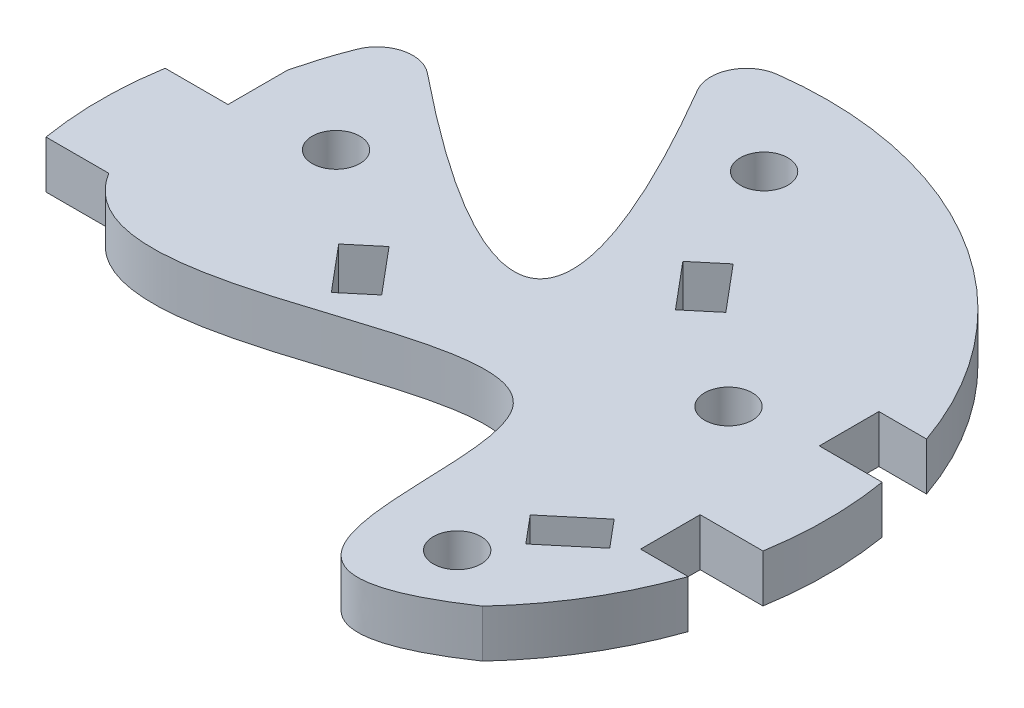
ISO-10303-21;
HEADER;
FILE_DESCRIPTION(('STEP AP214'),'2;1');
FILE_NAME('part.step','',(''),(''),'','','');
FILE_SCHEMA(('AUTOMOTIVE_DESIGN { 1 0 10303 214 1 1 1 1 }'));
ENDSEC;
DATA;
#1=APPLICATION_CONTEXT('core data for automotive mechanical design processes');
#2=APPLICATION_PROTOCOL_DEFINITION('international standard','automotive_design',2000,#1);
#3=PRODUCT_CONTEXT('',#1,'mechanical');
#4=PRODUCT('Part','Part','',(#3));
#5=PRODUCT_RELATED_PRODUCT_CATEGORY('part','',(#4));
#6=PRODUCT_DEFINITION_FORMATION('','',#4);
#7=PRODUCT_DEFINITION_CONTEXT('part definition',#1,'design');
#8=PRODUCT_DEFINITION('design','',#6,#7);
#9=PRODUCT_DEFINITION_SHAPE('','',#8);
#10=(LENGTH_UNIT() NAMED_UNIT(*) SI_UNIT(.MILLI.,.METRE.));
#11=(NAMED_UNIT(*) PLANE_ANGLE_UNIT() SI_UNIT($,.RADIAN.));
#12=(NAMED_UNIT(*) SI_UNIT($,.STERADIAN.) SOLID_ANGLE_UNIT());
#13=UNCERTAINTY_MEASURE_WITH_UNIT(LENGTH_MEASURE(1.E-05),#10,'distance_accuracy_value','');
#14=(GEOMETRIC_REPRESENTATION_CONTEXT(3) GLOBAL_UNCERTAINTY_ASSIGNED_CONTEXT((#13)) GLOBAL_UNIT_ASSIGNED_CONTEXT((#10,
#11,#12)) REPRESENTATION_CONTEXT('',''));
#15=CARTESIAN_POINT('',(0.,0.,0.));
#16=DIRECTION('',(0.,0.,1.));
#17=DIRECTION('',(1.,0.,0.));
#18=AXIS2_PLACEMENT_3D('',#15,#16,#17);
#19=CARTESIAN_POINT('',(0.,4.,0.));
#20=DIRECTION('',(0.,1.,0.));
#21=DIRECTION('',(0.,0.,1.));
#22=AXIS2_PLACEMENT_3D('',#19,#20,#21);
#23=PLANE('',#22);
#24=CARTESIAN_POINT('',(17.204026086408,4.,17.7804431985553));
#25=DIRECTION('',(0.,1.,0.));
#26=DIRECTION('',(0.,0.,1.));
#27=AXIS2_PLACEMENT_3D('',#24,#25,#26);
#28=CIRCLE('',#27,2.);
#29=CARTESIAN_POINT('',(17.204026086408,4.,19.7804431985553));
#30=VERTEX_POINT('',#29);
#31=EDGE_CURVE('E470',#30,#30,#28,.F.);
#32=ORIENTED_EDGE('',*,*,#31,.T.);
#33=EDGE_LOOP('',(#32));
#34=FACE_BOUND('',#33,.T.);
#35=DIRECTION('',(-0.766044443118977,0.,0.642787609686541));
#36=VECTOR('',#35,1.);
#37=CARTESIAN_POINT('',(-3.90227068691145,4.,-4.65054511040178));
#38=LINE('',#37,#36);
#39=CARTESIAN_POINT('',(-7.73249290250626,4.,-1.43660706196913));
#40=VERTEX_POINT('',#39);
#41=CARTESIAN_POINT('',(-10.0306262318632,4.,0.491755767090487));
#42=VERTEX_POINT('',#41);
#43=EDGE_CURVE('E483',#40,#42,#38,.T.);
#44=ORIENTED_EDGE('',*,*,#43,.F.);
#45=DIRECTION('',(0.642787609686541,0.,0.766044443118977));
#46=VECTOR('',#45,1.);
#47=CARTESIAN_POINT('',(-3.83022221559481,4.,3.21393804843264));
#48=LINE('',#47,#46);
#49=CARTESIAN_POINT('',(-4.51855485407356,4.,2.39361515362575));
#50=VERTEX_POINT('',#49);
#51=EDGE_CURVE('E480',#40,#50,#48,.T.);
#52=ORIENTED_EDGE('',*,*,#51,.T.);
#53=DIRECTION('',(0.766044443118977,0.,-0.642787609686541));
#54=VECTOR('',#53,1.);
#55=CARTESIAN_POINT('',(-0.688332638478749,4.,-0.820322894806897));
#56=LINE('',#55,#54);
#57=CARTESIAN_POINT('',(-6.81668818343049,4.,4.32197798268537));
#58=VERTEX_POINT('',#57);
#59=EDGE_CURVE('E489',#58,#50,#56,.T.);
#60=ORIENTED_EDGE('',*,*,#59,.F.);
#61=DIRECTION('',(0.642787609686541,0.,0.766044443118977));
#62=VECTOR('',#61,1.);
#63=CARTESIAN_POINT('',(-6.12835554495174,4.,5.14230087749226));
#64=LINE('',#63,#62);
#65=EDGE_CURVE('E486',#42,#58,#64,.T.);
#66=ORIENTED_EDGE('',*,*,#65,.F.);
#67=EDGE_LOOP('',(#44,#52,#60,#66));
#68=FACE_BOUND('',#67,.T.);
#69=CARTESIAN_POINT('',(0.,4.,0.));
#70=DIRECTION('',(0.,1.,0.));
#71=DIRECTION('',(0.,0.,1.));
#72=AXIS2_PLACEMENT_3D('',#69,#70,#71);
#73=CIRCLE('',#72,30.5);
#74=CARTESIAN_POINT('',(28.8140590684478,4.,-10.));
#75=VERTEX_POINT('',#74);
#76=CARTESIAN_POINT('',(-3.95861769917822,4.,-30.2420129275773));
#77=VERTEX_POINT('',#76);
#78=EDGE_CURVE('E735',#75,#77,#73,.T.);
#79=ORIENTED_EDGE('',*,*,#78,.T.);
#80=CARTESIAN_POINT('',(-3.56924546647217,4.,-27.2673887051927));
#81=DIRECTION('',(0.,1.,0.));
#82=DIRECTION('',(0.,0.,1.));
#83=AXIS2_PLACEMENT_3D('',#80,#81,#82);
#84=CIRCLE('',#83,3.);
#85=CARTESIAN_POINT('',(-6.16007700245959,4.,-25.7549099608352));
#86=VERTEX_POINT('',#85);
#87=EDGE_CURVE('E265',#77,#86,#84,.T.);
#88=ORIENTED_EDGE('',*,*,#87,.T.);
#89=CARTESIAN_POINT('',(-18.7453208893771,4.,-15.6645535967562));
#90=CARTESIAN_POINT('',(3.8670009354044,4.,2.57649625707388));
#91=CARTESIAN_POINT('',(8.09424648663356,4.,-2.49637913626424));
#92=CARTESIAN_POINT('',(-8.30734565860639,4.,-29.3468568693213));
#93=B_SPLINE_CURVE_WITH_KNOTS('',3,(#89,#90,#91,#92),.UNSPECIFIED.,.F.,.F.,(4,4),
(0.0405275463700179,1.),.UNSPECIFIED.);
#94=CARTESIAN_POINT('',(-18.7453208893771,4.,-15.6645535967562));
#95=VERTEX_POINT('',#94);
#96=EDGE_CURVE('E937',#95,#86,#93,.T.);
#97=ORIENTED_EDGE('',*,*,#96,.F.);
#98=CARTESIAN_POINT('',(-20.6289102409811,4.,-13.3295822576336));
#99=DIRECTION('',(0.,1.,0.));
#100=DIRECTION('',(0.,0.,1.));
#101=AXIS2_PLACEMENT_3D('',#98,#99,#100);
#102=CIRCLE('',#101,3.);
#103=CARTESIAN_POINT('',(-23.4189051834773,4.,-14.4322736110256));
#104=VERTEX_POINT('',#103);
#105=EDGE_CURVE('E495',#104,#95,#102,.F.);
#106=ORIENTED_EDGE('',*,*,#105,.F.);
#107=CARTESIAN_POINT('',(-24.8140590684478,4.,5.));
#108=CARTESIAN_POINT('',(-26.3603422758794,4.,-1.58958445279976));
#109=CARTESIAN_POINT('',(-25.8362968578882,4.,-8.31586531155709));
#110=CARTESIAN_POINT('',(-23.4189051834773,4.,-14.4322736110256));
#111=B_SPLINE_CURVE_WITH_KNOTS('',3,(#107,#108,#109,#110),.UNSPECIFIED.,.F.,.F.,(4,4),(0.,
0.831813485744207),.UNSPECIFIED.);
#112=CARTESIAN_POINT('',(-24.8140590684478,4.,-10.));
#113=VERTEX_POINT('',#112);
#114=EDGE_CURVE('E930',#113,#104,#111,.T.);
#115=ORIENTED_EDGE('',*,*,#114,.F.);
#116=DIRECTION('',(0.,0.,-1.));
#117=VECTOR('',#116,1.);
#118=CARTESIAN_POINT('',(-24.8140590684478,4.,0.));
#119=LINE('',#118,#117);
#120=CARTESIAN_POINT('',(-24.8140590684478,4.,-5.));
#121=VERTEX_POINT('',#120);
#122=EDGE_CURVE('E646',#121,#113,#119,.T.);
#123=ORIENTED_EDGE('',*,*,#122,.F.);
#124=DIRECTION('',(-1.,0.,0.));
#125=VECTOR('',#124,1.);
#126=CARTESIAN_POINT('',(0.,4.,-5.));
#127=LINE('',#126,#125);
#128=CARTESIAN_POINT('',(-30.0873727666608,4.,-5.));
#129=VERTEX_POINT('',#128);
#130=EDGE_CURVE('E636',#121,#129,#127,.T.);
#131=ORIENTED_EDGE('',*,*,#130,.T.);
#132=CARTESIAN_POINT('',(-30.0873727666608,4.,5.));
#133=VERTEX_POINT('',#132);
#134=EDGE_CURVE('E668',#129,#133,#73,.T.);
#135=ORIENTED_EDGE('',*,*,#134,.T.);
#136=DIRECTION('',(-1.,0.,0.));
#137=VECTOR('',#136,1.);
#138=CARTESIAN_POINT('',(0.,4.,5.00000000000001));
#139=LINE('',#138,#137);
#140=CARTESIAN_POINT('',(-24.8140590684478,4.,5.));
#141=VERTEX_POINT('',#140);
#142=EDGE_CURVE('E653',#141,#133,#139,.T.);
#143=ORIENTED_EDGE('',*,*,#142,.F.);
#144=CARTESIAN_POINT('',(22.3289408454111,4.,20.7766311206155));
#145=CARTESIAN_POINT('',(5.97375164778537,4.,31.8512079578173));
#146=CARTESIAN_POINT('',(22.176782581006,4.,-15.835204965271));
#147=CARTESIAN_POINT('',(-18.2068680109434,4.,15.8076452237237));
#148=CARTESIAN_POINT('',(-24.8140590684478,4.,5.));
#149=B_SPLINE_CURVE_WITH_KNOTS('',3,(#144,#145,#146,#147,#148),.UNSPECIFIED.,.F.,.F.,(4,1,4),
(0.,0.445790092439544,1.),.UNSPECIFIED.);
#150=CARTESIAN_POINT('',(22.3289408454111,4.,20.7766311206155));
#151=VERTEX_POINT('',#150);
#152=EDGE_CURVE('E540',#151,#141,#149,.T.);
#153=ORIENTED_EDGE('',*,*,#152,.F.);
#154=CARTESIAN_POINT('',(28.8140590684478,4.,10.));
#155=VERTEX_POINT('',#154);
#156=EDGE_CURVE('E664',#151,#155,#73,.T.);
#157=ORIENTED_EDGE('',*,*,#156,.T.);
#158=DIRECTION('',(1.,0.,0.));
#159=VECTOR('',#158,1.);
#160=CARTESIAN_POINT('',(0.,4.,10.));
#161=LINE('',#160,#159);
#162=CARTESIAN_POINT('',(24.8140590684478,4.,10.));
#163=VERTEX_POINT('',#162);
#164=EDGE_CURVE('E604',#163,#155,#161,.T.);
#165=ORIENTED_EDGE('',*,*,#164,.F.);
#166=DIRECTION('',(0.,0.,1.));
#167=VECTOR('',#166,1.);
#168=CARTESIAN_POINT('',(24.8140590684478,4.,0.));
#169=LINE('',#168,#167);
#170=CARTESIAN_POINT('',(24.8140590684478,4.,5.));
#171=VERTEX_POINT('',#170);
#172=EDGE_CURVE('E585',#171,#163,#169,.T.);
#173=ORIENTED_EDGE('',*,*,#172,.F.);
#174=DIRECTION('',(1.,0.,0.));
#175=VECTOR('',#174,1.);
#176=CARTESIAN_POINT('',(0.,4.,5.));
#177=LINE('',#176,#175);
#178=CARTESIAN_POINT('',(30.0873727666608,4.,5.));
#179=VERTEX_POINT('',#178);
#180=EDGE_CURVE('E596',#171,#179,#177,.T.);
#181=ORIENTED_EDGE('',*,*,#180,.T.);
#182=CARTESIAN_POINT('',(30.0873727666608,4.,-5.));
#183=VERTEX_POINT('',#182);
#184=EDGE_CURVE('E667',#179,#183,#73,.T.);
#185=ORIENTED_EDGE('',*,*,#184,.T.);
#186=DIRECTION('',(1.,0.,0.));
#187=VECTOR('',#186,1.);
#188=CARTESIAN_POINT('',(0.,4.,-5.00000000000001));
#189=LINE('',#188,#187);
#190=CARTESIAN_POINT('',(24.8140590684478,4.,-5.));
#191=VERTEX_POINT('',#190);
#192=EDGE_CURVE('E621',#191,#183,#189,.T.);
#193=ORIENTED_EDGE('',*,*,#192,.F.);
#194=DIRECTION('',(0.,0.,-1.));
#195=VECTOR('',#194,1.);
#196=CARTESIAN_POINT('',(24.8140590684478,4.,0.));
#197=LINE('',#196,#195);
#198=CARTESIAN_POINT('',(24.8140590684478,4.,-10.));
#199=VERTEX_POINT('',#198);
#200=EDGE_CURVE('E629',#191,#199,#197,.T.);
#201=ORIENTED_EDGE('',*,*,#200,.T.);
#202=DIRECTION('',(1.,0.,0.));
#203=VECTOR('',#202,1.);
#204=CARTESIAN_POINT('',(0.,4.,-10.));
#205=LINE('',#204,#203);
#206=EDGE_CURVE('E611',#199,#75,#205,.T.);
#207=ORIENTED_EDGE('',*,*,#206,.T.);
#208=EDGE_LOOP('',(#79,#88,#97,#106,#115,#123,#131,#135,#143,#153,#157,#165,#173,#181,#185,#193,
#201,#207));
#209=FACE_BOUND('',#208,.T.);
#210=CARTESIAN_POINT('',(2.55063188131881,4.,-22.6297184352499));
#211=DIRECTION('',(0.,1.,0.));
#212=DIRECTION('',(0.,0.,1.));
#213=AXIS2_PLACEMENT_3D('',#210,#211,#212);
#214=CIRCLE('',#213,2.);
#215=CARTESIAN_POINT('',(2.55063188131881,4.,-20.6297184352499));
#216=VERTEX_POINT('',#215);
#217=EDGE_CURVE('E555',#216,#216,#214,.T.);
#218=ORIENTED_EDGE('',*,*,#217,.F.);
#219=EDGE_LOOP('',(#218));
#220=FACE_BOUND('',#219,.T.);
#221=CARTESIAN_POINT('',(18.1382314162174,4.,-4.05314068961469));
#222=DIRECTION('',(0.,1.,0.));
#223=DIRECTION('',(0.,0.,1.));
#224=AXIS2_PLACEMENT_3D('',#221,#222,#223);
#225=CIRCLE('',#224,2.);
#226=CARTESIAN_POINT('',(18.1382314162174,4.,-2.05314068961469));
#227=VERTEX_POINT('',#226);
#228=EDGE_CURVE('E566',#227,#227,#225,.T.);
#229=ORIENTED_EDGE('',*,*,#228,.F.);
#230=EDGE_LOOP('',(#229));
#231=FACE_BOUND('',#230,.T.);
#232=DIRECTION('',(-0.766044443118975,0.,0.642787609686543));
#233=VECTOR('',#232,1.);
#234=CARTESIAN_POINT('',(-3.90227068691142,4.,-4.65054511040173));
#235=LINE('',#234,#233);
#236=CARTESIAN_POINT('',(7.97141818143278,4.,-14.6137530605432));
#237=VERTEX_POINT('',#236);
#238=CARTESIAN_POINT('',(5.67328485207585,4.,-12.6853902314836));
#239=VERTEX_POINT('',#238);
#240=EDGE_CURVE('E573',#237,#239,#235,.T.);
#241=ORIENTED_EDGE('',*,*,#240,.F.);
#242=DIRECTION('',(0.642787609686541,0.,0.766044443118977));
#243=VECTOR('',#242,1.);
#244=CARTESIAN_POINT('',(11.8736888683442,4.,-9.96320795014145));
#245=LINE('',#244,#243);
#246=CARTESIAN_POINT('',(11.1853562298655,4.,-10.7835308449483));
#247=VERTEX_POINT('',#246);
#248=EDGE_CURVE('E570',#237,#247,#245,.T.);
#249=ORIENTED_EDGE('',*,*,#248,.T.);
#250=DIRECTION('',(-0.766044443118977,0.,0.642787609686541));
#251=VECTOR('',#250,1.);
#252=CARTESIAN_POINT('',(-0.688332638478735,4.,-0.820322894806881));
#253=LINE('',#252,#251);
#254=CARTESIAN_POINT('',(8.88722290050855,4.,-8.8551680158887));
#255=VERTEX_POINT('',#254);
#256=EDGE_CURVE('E579',#247,#255,#253,.T.);
#257=ORIENTED_EDGE('',*,*,#256,.T.);
#258=DIRECTION('',(0.64278760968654,0.,0.766044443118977));
#259=VECTOR('',#258,1.);
#260=CARTESIAN_POINT('',(9.57555553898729,4.,-8.03484512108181));
#261=LINE('',#260,#259);
#262=EDGE_CURVE('E576',#239,#255,#261,.T.);
#263=ORIENTED_EDGE('',*,*,#262,.F.);
#264=EDGE_LOOP('',(#241,#249,#257,#263));
#265=FACE_BOUND('',#264,.T.);
#266=CARTESIAN_POINT('',(-16.9835014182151,4.,-6.23863438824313));
#267=DIRECTION('',(0.,1.,0.));
#268=DIRECTION('',(0.,0.,1.));
#269=AXIS2_PLACEMENT_3D('',#266,#267,#268);
#270=CIRCLE('',#269,2.);
#271=CARTESIAN_POINT('',(-16.9835014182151,4.,-4.23863438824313));
#272=VERTEX_POINT('',#271);
#273=EDGE_CURVE('E476',#272,#272,#270,.F.);
#274=ORIENTED_EDGE('',*,*,#273,.T.);
#275=EDGE_LOOP('',(#274));
#276=FACE_BOUND('',#275,.T.);
#277=DIRECTION('',(0.642787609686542,0.,0.766044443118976));
#278=VECTOR('',#277,1.);
#279=CARTESIAN_POINT('',(4.40475554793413,4.,-3.69602875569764));
#280=LINE('',#279,#278);
#281=CARTESIAN_POINT('',(17.6970534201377,4.,12.1451149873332));
#282=VERTEX_POINT('',#281);
#283=CARTESIAN_POINT('',(19.6254162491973,4.,14.4432483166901));
#284=VERTEX_POINT('',#283);
#285=EDGE_CURVE('E455',#282,#284,#280,.T.);
#286=ORIENTED_EDGE('',*,*,#285,.F.);
#287=DIRECTION('',(0.766044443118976,0.,-0.642787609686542));
#288=VECTOR('',#287,1.);
#289=CARTESIAN_POINT('',(13.2922978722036,4.,15.8411437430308));
#290=LINE('',#289,#288);
#291=CARTESIAN_POINT('',(21.5272756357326,4.,8.9311769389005));
#292=VERTEX_POINT('',#291);
#293=EDGE_CURVE('E460',#282,#292,#290,.T.);
#294=ORIENTED_EDGE('',*,*,#293,.T.);
#295=DIRECTION('',(0.642787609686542,0.,0.766044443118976));
#296=VECTOR('',#295,1.);
#297=CARTESIAN_POINT('',(8.23497776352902,4.,-6.90996680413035));
#298=LINE('',#297,#296);
#299=CARTESIAN_POINT('',(23.4556384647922,4.,11.2293102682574));
#300=VERTEX_POINT('',#299);
#301=EDGE_CURVE('E463',#292,#300,#298,.T.);
#302=ORIENTED_EDGE('',*,*,#301,.T.);
#303=DIRECTION('',(0.766044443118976,0.,-0.642787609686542));
#304=VECTOR('',#303,1.);
#305=CARTESIAN_POINT('',(15.2206607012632,4.,18.1392770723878));
#306=LINE('',#305,#304);
#307=EDGE_CURVE('E444',#284,#300,#306,.T.);
#308=ORIENTED_EDGE('',*,*,#307,.F.);
#309=EDGE_LOOP('',(#286,#294,#302,#308));
#310=FACE_BOUND('',#309,.T.);
#311=ADVANCED_FACE('F243',(#34,#68,#209,#220,#231,#265,#276,#310),#23,.T.);
#312=CARTESIAN_POINT('',(0.,0.,0.));
#313=DIRECTION('',(0.,1.,0.));
#314=DIRECTION('',(0.,0.,1.));
#315=AXIS2_PLACEMENT_3D('',#312,#313,#314);
#316=PLANE('',#315);
#317=CARTESIAN_POINT('',(17.204026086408,0.,17.7804431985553));
#318=DIRECTION('',(0.,1.,0.));
#319=DIRECTION('',(0.,0.,1.));
#320=AXIS2_PLACEMENT_3D('',#317,#318,#319);
#321=CIRCLE('',#320,2.);
#322=CARTESIAN_POINT('',(17.204026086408,0.,19.7804431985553));
#323=VERTEX_POINT('',#322);
#324=EDGE_CURVE('E475',#323,#323,#321,.F.);
#325=ORIENTED_EDGE('',*,*,#324,.F.);
#326=EDGE_LOOP('',(#325));
#327=FACE_BOUND('',#326,.T.);
#328=DIRECTION('',(0.642787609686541,0.,0.766044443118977));
#329=VECTOR('',#328,1.);
#330=CARTESIAN_POINT('',(-3.83022221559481,0.,3.21393804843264));
#331=LINE('',#330,#329);
#332=CARTESIAN_POINT('',(-7.73249290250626,0.,-1.43660706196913));
#333=VERTEX_POINT('',#332);
#334=CARTESIAN_POINT('',(-4.51855485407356,0.,2.39361515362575));
#335=VERTEX_POINT('',#334);
#336=EDGE_CURVE('E713',#333,#335,#331,.T.);
#337=ORIENTED_EDGE('',*,*,#336,.F.);
#338=DIRECTION('',(-0.766044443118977,0.,0.642787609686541));
#339=VECTOR('',#338,1.);
#340=CARTESIAN_POINT('',(-3.90227068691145,0.,-4.65054511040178));
#341=LINE('',#340,#339);
#342=CARTESIAN_POINT('',(-10.0306262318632,0.,0.491755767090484));
#343=VERTEX_POINT('',#342);
#344=EDGE_CURVE('E697',#333,#343,#341,.T.);
#345=ORIENTED_EDGE('',*,*,#344,.T.);
#346=DIRECTION('',(0.642787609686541,0.,0.766044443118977));
#347=VECTOR('',#346,1.);
#348=CARTESIAN_POINT('',(-6.12835554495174,0.,5.14230087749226));
#349=LINE('',#348,#347);
#350=CARTESIAN_POINT('',(-6.81668818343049,0.,4.32197798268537));
#351=VERTEX_POINT('',#350);
#352=EDGE_CURVE('E707',#343,#351,#349,.T.);
#353=ORIENTED_EDGE('',*,*,#352,.T.);
#354=DIRECTION('',(0.766044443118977,0.,-0.642787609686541));
#355=VECTOR('',#354,1.);
#356=CARTESIAN_POINT('',(-0.688332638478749,0.,-0.820322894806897));
#357=LINE('',#356,#355);
#358=EDGE_CURVE('E710',#351,#335,#357,.T.);
#359=ORIENTED_EDGE('',*,*,#358,.T.);
#360=EDGE_LOOP('',(#337,#345,#353,#359));
#361=FACE_BOUND('',#360,.T.);
#362=CARTESIAN_POINT('',(2.55063188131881,0.,-22.6297184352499));
#363=DIRECTION('',(0.,1.,0.));
#364=DIRECTION('',(0.,0.,1.));
#365=AXIS2_PLACEMENT_3D('',#362,#363,#364);
#366=CIRCLE('',#365,2.);
#367=CARTESIAN_POINT('',(2.55063188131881,0.,-20.6297184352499));
#368=VERTEX_POINT('',#367);
#369=EDGE_CURVE('E565',#368,#368,#366,.T.);
#370=ORIENTED_EDGE('',*,*,#369,.T.);
#371=EDGE_LOOP('',(#370));
#372=FACE_BOUND('',#371,.T.);
#373=CARTESIAN_POINT('',(18.1382314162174,0.,-4.05314068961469));
#374=DIRECTION('',(0.,1.,0.));
#375=DIRECTION('',(0.,0.,1.));
#376=AXIS2_PLACEMENT_3D('',#373,#374,#375);
#377=CIRCLE('',#376,2.);
#378=CARTESIAN_POINT('',(18.1382314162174,0.,-2.05314068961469));
#379=VERTEX_POINT('',#378);
#380=EDGE_CURVE('E569',#379,#379,#377,.T.);
#381=ORIENTED_EDGE('',*,*,#380,.T.);
#382=EDGE_LOOP('',(#381));
#383=FACE_BOUND('',#382,.T.);
#384=CARTESIAN_POINT('',(-18.7453208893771,0.,-15.6645535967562));
#385=CARTESIAN_POINT('',(3.8670009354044,0.,2.57649625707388));
#386=CARTESIAN_POINT('',(8.09424648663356,0.,-2.49637913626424));
#387=CARTESIAN_POINT('',(-8.30734565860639,0.,-29.3468568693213));
#388=B_SPLINE_CURVE_WITH_KNOTS('',3,(#384,#385,#386,#387),.UNSPECIFIED.,.F.,.F.,(4,4),
(0.0405275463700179,1.),.UNSPECIFIED.);
#389=CARTESIAN_POINT('',(-18.7453208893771,0.,-15.6645535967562));
#390=VERTEX_POINT('',#389);
#391=CARTESIAN_POINT('',(-6.16007700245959,0.,-25.7549099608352));
#392=VERTEX_POINT('',#391);
#393=EDGE_CURVE('E536',#390,#392,#388,.T.);
#394=ORIENTED_EDGE('',*,*,#393,.T.);
#395=CARTESIAN_POINT('',(-3.56924546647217,0.,-27.2673887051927));
#396=DIRECTION('',(0.,1.,0.));
#397=DIRECTION('',(0.,0.,1.));
#398=AXIS2_PLACEMENT_3D('',#395,#396,#397);
#399=CIRCLE('',#398,3.);
#400=CARTESIAN_POINT('',(-3.95861769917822,0.,-30.2420129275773));
#401=VERTEX_POINT('',#400);
#402=EDGE_CURVE('E12',#392,#401,#399,.F.);
#403=ORIENTED_EDGE('',*,*,#402,.T.);
#404=CARTESIAN_POINT('',(0.,0.,0.));
#405=DIRECTION('',(0.,1.,0.));
#406=DIRECTION('',(0.,0.,1.));
#407=AXIS2_PLACEMENT_3D('',#404,#405,#406);
#408=CIRCLE('',#407,30.5);
#409=CARTESIAN_POINT('',(28.8140590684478,0.,-10.));
#410=VERTEX_POINT('',#409);
#411=EDGE_CURVE('E737',#410,#401,#408,.T.);
#412=ORIENTED_EDGE('',*,*,#411,.F.);
#413=DIRECTION('',(1.,0.,0.));
#414=VECTOR('',#413,1.);
#415=CARTESIAN_POINT('',(0.,0.,-10.));
#416=LINE('',#415,#414);
#417=CARTESIAN_POINT('',(24.8140590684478,0.,-10.));
#418=VERTEX_POINT('',#417);
#419=EDGE_CURVE('E618',#418,#410,#416,.T.);
#420=ORIENTED_EDGE('',*,*,#419,.F.);
#421=DIRECTION('',(0.,0.,-1.));
#422=VECTOR('',#421,1.);
#423=CARTESIAN_POINT('',(24.8140590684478,0.,0.));
#424=LINE('',#423,#422);
#425=CARTESIAN_POINT('',(24.8140590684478,0.,-5.));
#426=VERTEX_POINT('',#425);
#427=EDGE_CURVE('E620',#426,#418,#424,.T.);
#428=ORIENTED_EDGE('',*,*,#427,.F.);
#429=DIRECTION('',(1.,0.,0.));
#430=VECTOR('',#429,1.);
#431=CARTESIAN_POINT('',(0.,0.,-5.00000000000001));
#432=LINE('',#431,#430);
#433=CARTESIAN_POINT('',(30.0873727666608,0.,-5.));
#434=VERTEX_POINT('',#433);
#435=EDGE_CURVE('E623',#426,#434,#432,.T.);
#436=ORIENTED_EDGE('',*,*,#435,.T.);
#437=CARTESIAN_POINT('',(30.0873727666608,0.,5.));
#438=VERTEX_POINT('',#437);
#439=EDGE_CURVE('E671',#438,#434,#408,.T.);
#440=ORIENTED_EDGE('',*,*,#439,.F.);
#441=DIRECTION('',(1.,0.,0.));
#442=VECTOR('',#441,1.);
#443=CARTESIAN_POINT('',(0.,0.,5.));
#444=LINE('',#443,#442);
#445=CARTESIAN_POINT('',(24.8140590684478,0.,5.));
#446=VERTEX_POINT('',#445);
#447=EDGE_CURVE('E599',#446,#438,#444,.T.);
#448=ORIENTED_EDGE('',*,*,#447,.F.);
#449=DIRECTION('',(0.,0.,1.));
#450=VECTOR('',#449,1.);
#451=CARTESIAN_POINT('',(24.8140590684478,0.,0.));
#452=LINE('',#451,#450);
#453=CARTESIAN_POINT('',(24.8140590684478,0.,10.));
#454=VERTEX_POINT('',#453);
#455=EDGE_CURVE('E592',#446,#454,#452,.T.);
#456=ORIENTED_EDGE('',*,*,#455,.T.);
#457=DIRECTION('',(1.,0.,0.));
#458=VECTOR('',#457,1.);
#459=CARTESIAN_POINT('',(0.,0.,10.));
#460=LINE('',#459,#458);
#461=CARTESIAN_POINT('',(28.8140590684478,0.,10.));
#462=VERTEX_POINT('',#461);
#463=EDGE_CURVE('E595',#454,#462,#460,.T.);
#464=ORIENTED_EDGE('',*,*,#463,.T.);
#465=CARTESIAN_POINT('',(22.3289408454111,0.,20.7766311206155));
#466=VERTEX_POINT('',#465);
#467=EDGE_CURVE('E669',#466,#462,#408,.T.);
#468=ORIENTED_EDGE('',*,*,#467,.F.);
#469=CARTESIAN_POINT('',(22.3289408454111,0.,20.7766311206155));
#470=CARTESIAN_POINT('',(5.97375164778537,0.,31.8512079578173));
#471=CARTESIAN_POINT('',(22.176782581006,0.,-15.835204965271));
#472=CARTESIAN_POINT('',(-18.2068680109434,0.,15.8076452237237));
#473=CARTESIAN_POINT('',(-24.8140590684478,0.,5.));
#474=B_SPLINE_CURVE_WITH_KNOTS('',3,(#469,#470,#471,#472,#473),.UNSPECIFIED.,.F.,.F.,(4,1,4),
(0.,0.445790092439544,1.),.UNSPECIFIED.);
#475=CARTESIAN_POINT('',(-24.8140590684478,0.,5.));
#476=VERTEX_POINT('',#475);
#477=EDGE_CURVE('E552',#466,#476,#474,.T.);
#478=ORIENTED_EDGE('',*,*,#477,.T.);
#479=DIRECTION('',(-1.,0.,0.));
#480=VECTOR('',#479,1.);
#481=CARTESIAN_POINT('',(0.,0.,5.00000000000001));
#482=LINE('',#481,#480);
#483=CARTESIAN_POINT('',(-30.0873727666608,0.,5.));
#484=VERTEX_POINT('',#483);
#485=EDGE_CURVE('E659',#476,#484,#482,.T.);
#486=ORIENTED_EDGE('',*,*,#485,.T.);
#487=CARTESIAN_POINT('',(-30.0873727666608,0.,-5.));
#488=VERTEX_POINT('',#487);
#489=EDGE_CURVE('E672',#488,#484,#408,.T.);
#490=ORIENTED_EDGE('',*,*,#489,.F.);
#491=DIRECTION('',(-1.,0.,0.));
#492=VECTOR('',#491,1.);
#493=CARTESIAN_POINT('',(0.,0.,-5.));
#494=LINE('',#493,#492);
#495=CARTESIAN_POINT('',(-24.8140590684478,0.,-5.));
#496=VERTEX_POINT('',#495);
#497=EDGE_CURVE('E643',#496,#488,#494,.T.);
#498=ORIENTED_EDGE('',*,*,#497,.F.);
#499=DIRECTION('',(0.,0.,-1.));
#500=VECTOR('',#499,1.);
#501=CARTESIAN_POINT('',(-24.8140590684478,0.,0.));
#502=LINE('',#501,#500);
#503=CARTESIAN_POINT('',(-24.8140590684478,0.,-10.));
#504=VERTEX_POINT('',#503);
#505=EDGE_CURVE('E645',#496,#504,#502,.T.);
#506=ORIENTED_EDGE('',*,*,#505,.T.);
#507=CARTESIAN_POINT('',(-24.8140590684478,0.,5.));
#508=CARTESIAN_POINT('',(-26.3603422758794,0.,-1.58958445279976));
#509=CARTESIAN_POINT('',(-25.8362968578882,0.,-8.31586531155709));
#510=CARTESIAN_POINT('',(-23.4189051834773,0.,-14.4322736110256));
#511=B_SPLINE_CURVE_WITH_KNOTS('',3,(#507,#508,#509,#510),.UNSPECIFIED.,.F.,.F.,(4,4),(0.,
0.831813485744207),.UNSPECIFIED.);
#512=CARTESIAN_POINT('',(-23.4189051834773,0.,-14.4322736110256));
#513=VERTEX_POINT('',#512);
#514=EDGE_CURVE('E933',#504,#513,#511,.T.);
#515=ORIENTED_EDGE('',*,*,#514,.T.);
#516=CARTESIAN_POINT('',(-20.6289102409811,0.,-13.3295822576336));
#517=DIRECTION('',(0.,1.,0.));
#518=DIRECTION('',(0.,0.,1.));
#519=AXIS2_PLACEMENT_3D('',#516,#517,#518);
#520=CIRCLE('',#519,3.);
#521=EDGE_CURVE('E682',#513,#390,#520,.F.);
#522=ORIENTED_EDGE('',*,*,#521,.T.);
#523=EDGE_LOOP('',(#394,#403,#412,#420,#428,#436,#440,#448,#456,#464,#468,#478,#486,#490,#498,
#506,#515,#522));
#524=FACE_BOUND('',#523,.T.);
#525=DIRECTION('',(0.642787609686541,0.,0.766044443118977));
#526=VECTOR('',#525,1.);
#527=CARTESIAN_POINT('',(11.8736888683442,0.,-9.96320795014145));
#528=LINE('',#527,#526);
#529=CARTESIAN_POINT('',(7.97141818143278,0.,-14.6137530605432));
#530=VERTEX_POINT('',#529);
#531=CARTESIAN_POINT('',(11.1853562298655,0.,-10.7835308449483));
#532=VERTEX_POINT('',#531);
#533=EDGE_CURVE('E680',#530,#532,#528,.T.);
#534=ORIENTED_EDGE('',*,*,#533,.F.);
#535=DIRECTION('',(-0.766044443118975,0.,0.642787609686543));
#536=VECTOR('',#535,1.);
#537=CARTESIAN_POINT('',(-3.90227068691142,0.,-4.65054511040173));
#538=LINE('',#537,#536);
#539=CARTESIAN_POINT('',(5.67328485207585,0.,-12.6853902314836));
#540=VERTEX_POINT('',#539);
#541=EDGE_CURVE('E666',#530,#540,#538,.T.);
#542=ORIENTED_EDGE('',*,*,#541,.T.);
#543=DIRECTION('',(0.64278760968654,0.,0.766044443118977));
#544=VECTOR('',#543,1.);
#545=CARTESIAN_POINT('',(9.57555553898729,0.,-8.03484512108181));
#546=LINE('',#545,#544);
#547=CARTESIAN_POINT('',(8.88722290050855,0.,-8.8551680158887));
#548=VERTEX_POINT('',#547);
#549=EDGE_CURVE('E675',#540,#548,#546,.T.);
#550=ORIENTED_EDGE('',*,*,#549,.T.);
#551=DIRECTION('',(-0.766044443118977,0.,0.642787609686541));
#552=VECTOR('',#551,1.);
#553=CARTESIAN_POINT('',(-0.688332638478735,0.,-0.820322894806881));
#554=LINE('',#553,#552);
#555=EDGE_CURVE('E678',#532,#548,#554,.T.);
#556=ORIENTED_EDGE('',*,*,#555,.F.);
#557=EDGE_LOOP('',(#534,#542,#550,#556));
#558=FACE_BOUND('',#557,.T.);
#559=CARTESIAN_POINT('',(-16.9835014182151,0.,-6.23863438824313));
#560=DIRECTION('',(0.,1.,0.));
#561=DIRECTION('',(0.,0.,1.));
#562=AXIS2_PLACEMENT_3D('',#559,#560,#561);
#563=CIRCLE('',#562,2.);
#564=CARTESIAN_POINT('',(-16.9835014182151,0.,-4.23863438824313));
#565=VERTEX_POINT('',#564);
#566=EDGE_CURVE('E479',#565,#565,#563,.F.);
#567=ORIENTED_EDGE('',*,*,#566,.F.);
#568=EDGE_LOOP('',(#567));
#569=FACE_BOUND('',#568,.T.);
#570=DIRECTION('',(0.766044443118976,0.,-0.642787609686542));
#571=VECTOR('',#570,1.);
#572=CARTESIAN_POINT('',(13.2922978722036,0.,15.8411437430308));
#573=LINE('',#572,#571);
#574=CARTESIAN_POINT('',(17.6970534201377,0.,12.1451149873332));
#575=VERTEX_POINT('',#574);
#576=CARTESIAN_POINT('',(21.5272756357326,0.,8.9311769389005));
#577=VERTEX_POINT('',#576);
#578=EDGE_CURVE('E724',#575,#577,#573,.T.);
#579=ORIENTED_EDGE('',*,*,#578,.F.);
#580=DIRECTION('',(0.642787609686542,0.,0.766044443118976));
#581=VECTOR('',#580,1.);
#582=CARTESIAN_POINT('',(4.40475554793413,0.,-3.69602875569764));
#583=LINE('',#582,#581);
#584=CARTESIAN_POINT('',(19.6254162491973,0.,14.4432483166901));
#585=VERTEX_POINT('',#584);
#586=EDGE_CURVE('E715',#575,#585,#583,.T.);
#587=ORIENTED_EDGE('',*,*,#586,.T.);
#588=DIRECTION('',(0.766044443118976,0.,-0.642787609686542));
#589=VECTOR('',#588,1.);
#590=CARTESIAN_POINT('',(15.2206607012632,0.,18.1392770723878));
#591=LINE('',#590,#589);
#592=CARTESIAN_POINT('',(23.4556384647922,0.,11.2293102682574));
#593=VERTEX_POINT('',#592);
#594=EDGE_CURVE('E447',#585,#593,#591,.T.);
#595=ORIENTED_EDGE('',*,*,#594,.T.);
#596=DIRECTION('',(0.642787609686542,0.,0.766044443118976));
#597=VECTOR('',#596,1.);
#598=CARTESIAN_POINT('',(8.23497776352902,0.,-6.90996680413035));
#599=LINE('',#598,#597);
#600=EDGE_CURVE('E722',#577,#593,#599,.T.);
#601=ORIENTED_EDGE('',*,*,#600,.F.);
#602=EDGE_LOOP('',(#579,#587,#595,#601));
#603=FACE_BOUND('',#602,.T.);
#604=ADVANCED_FACE('F769',(#327,#361,#372,#383,#524,#558,#569,#603),#316,.F.);
#605=CARTESIAN_POINT('',(0.,4.,0.));
#606=DIRECTION('',(0.,-1.,0.));
#607=DIRECTION('',(0.,0.,-1.));
#608=AXIS2_PLACEMENT_3D('',#605,#606,#607);
#609=CYLINDRICAL_SURFACE('',#608,30.5);
#610=DIRECTION('',(0.,1.,0.));
#611=VECTOR('',#610,1.);
#612=CARTESIAN_POINT('',(30.0873727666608,0.,5.));
#613=LINE('',#612,#611);
#614=EDGE_CURVE('E612',#438,#179,#613,.T.);
#615=ORIENTED_EDGE('',*,*,#614,.F.);
#616=ORIENTED_EDGE('',*,*,#439,.T.);
#617=DIRECTION('',(0.,1.,0.));
#618=VECTOR('',#617,1.);
#619=CARTESIAN_POINT('',(30.0873727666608,0.,-5.));
#620=LINE('',#619,#618);
#621=EDGE_CURVE('E637',#434,#183,#620,.T.);
#622=ORIENTED_EDGE('',*,*,#621,.T.);
#623=ORIENTED_EDGE('',*,*,#184,.F.);
#624=EDGE_LOOP('',(#615,#616,#622,#623));
#625=FACE_BOUND('',#624,.T.);
#626=ADVANCED_FACE('F761',(#625),#609,.T.);
#627=ORIENTED_EDGE('',*,*,#411,.T.);
#628=DIRECTION('',(0.,-1.,0.));
#629=VECTOR('',#628,1.);
#630=CARTESIAN_POINT('',(-3.95861769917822,4.,-30.2420129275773));
#631=LINE('',#630,#629);
#632=EDGE_CURVE('E726',#401,#77,#631,.F.);
#633=ORIENTED_EDGE('',*,*,#632,.T.);
#634=ORIENTED_EDGE('',*,*,#78,.F.);
#635=DIRECTION('',(0.,1.,0.));
#636=VECTOR('',#635,1.);
#637=CARTESIAN_POINT('',(28.8140590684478,0.,-10.));
#638=LINE('',#637,#636);
#639=EDGE_CURVE('E634',#410,#75,#638,.T.);
#640=ORIENTED_EDGE('',*,*,#639,.F.);
#641=EDGE_LOOP('',(#627,#633,#634,#640));
#642=FACE_BOUND('',#641,.T.);
#643=ADVANCED_FACE('F733',(#642),#609,.T.);
#644=DIRECTION('',(0.,1.,0.));
#645=VECTOR('',#644,1.);
#646=CARTESIAN_POINT('',(-30.0873727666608,0.,-5.));
#647=LINE('',#646,#645);
#648=EDGE_CURVE('E651',#488,#129,#647,.T.);
#649=ORIENTED_EDGE('',*,*,#648,.F.);
#650=ORIENTED_EDGE('',*,*,#489,.T.);
#651=DIRECTION('',(0.,1.,0.));
#652=VECTOR('',#651,1.);
#653=CARTESIAN_POINT('',(-30.0873727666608,0.,5.));
#654=LINE('',#653,#652);
#655=EDGE_CURVE('E660',#484,#133,#654,.T.);
#656=ORIENTED_EDGE('',*,*,#655,.T.);
#657=ORIENTED_EDGE('',*,*,#134,.F.);
#658=EDGE_LOOP('',(#649,#650,#656,#657));
#659=FACE_BOUND('',#658,.T.);
#660=ADVANCED_FACE('F753',(#659),#609,.T.);
#661=ORIENTED_EDGE('',*,*,#156,.F.);
#662=DIRECTION('',(0.,1.,0.));
#663=VECTOR('',#662,1.);
#664=CARTESIAN_POINT('',(22.3289408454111,-6.,20.7766311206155));
#665=LINE('',#664,#663);
#666=EDGE_CURVE('E547',#466,#151,#665,.T.);
#667=ORIENTED_EDGE('',*,*,#666,.F.);
#668=ORIENTED_EDGE('',*,*,#467,.T.);
#669=DIRECTION('',(0.,1.,0.));
#670=VECTOR('',#669,1.);
#671=CARTESIAN_POINT('',(28.8140590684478,0.,10.));
#672=LINE('',#671,#670);
#673=EDGE_CURVE('E614',#462,#155,#672,.T.);
#674=ORIENTED_EDGE('',*,*,#673,.T.);
#675=EDGE_LOOP('',(#661,#667,#668,#674));
#676=FACE_BOUND('',#675,.T.);
#677=ADVANCED_FACE('F793',(#676),#609,.T.);
#678=CARTESIAN_POINT('',(0.,0.,5.00000000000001));
#679=DIRECTION('',(0.,0.,-1.));
#680=DIRECTION('',(-1.,0.,0.));
#681=AXIS2_PLACEMENT_3D('',#678,#679,#680);
#682=PLANE('',#681);
#683=ORIENTED_EDGE('',*,*,#142,.T.);
#684=ORIENTED_EDGE('',*,*,#655,.F.);
#685=ORIENTED_EDGE('',*,*,#485,.F.);
#686=DIRECTION('',(0.,1.,0.));
#687=VECTOR('',#686,1.);
#688=CARTESIAN_POINT('',(-24.8140590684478,0.,5.));
#689=LINE('',#688,#687);
#690=EDGE_CURVE('E663',#476,#141,#689,.T.);
#691=ORIENTED_EDGE('',*,*,#690,.T.);
#692=EDGE_LOOP('',(#683,#684,#685,#691));
#693=FACE_BOUND('',#692,.T.);
#694=ADVANCED_FACE('F751',(#693),#682,.F.);
#695=CARTESIAN_POINT('',(0.,0.,-5.));
#696=DIRECTION('',(0.,0.,-1.));
#697=DIRECTION('',(-1.,0.,0.));
#698=AXIS2_PLACEMENT_3D('',#695,#696,#697);
#699=PLANE('',#698);
#700=ORIENTED_EDGE('',*,*,#130,.F.);
#701=DIRECTION('',(0.,1.,0.));
#702=VECTOR('',#701,1.);
#703=CARTESIAN_POINT('',(-24.8140590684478,0.,-5.));
#704=LINE('',#703,#702);
#705=EDGE_CURVE('E655',#496,#121,#704,.T.);
#706=ORIENTED_EDGE('',*,*,#705,.F.);
#707=ORIENTED_EDGE('',*,*,#497,.T.);
#708=ORIENTED_EDGE('',*,*,#648,.T.);
#709=EDGE_LOOP('',(#700,#706,#707,#708));
#710=FACE_BOUND('',#709,.T.);
#711=ADVANCED_FACE('F800',(#710),#699,.T.);
#712=CARTESIAN_POINT('',(-24.8140590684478,0.,0.));
#713=DIRECTION('',(1.,0.,0.));
#714=DIRECTION('',(0.,0.,-1.));
#715=AXIS2_PLACEMENT_3D('',#712,#713,#714);
#716=PLANE('',#715);
#717=ORIENTED_EDGE('',*,*,#122,.T.);
#718=DIRECTION('',(0.,1.,0.));
#719=VECTOR('',#718,1.);
#720=CARTESIAN_POINT('',(-24.8140590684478,0.,-10.));
#721=LINE('',#720,#719);
#722=EDGE_CURVE('E654',#504,#113,#721,.T.);
#723=ORIENTED_EDGE('',*,*,#722,.F.);
#724=ORIENTED_EDGE('',*,*,#505,.F.);
#725=ORIENTED_EDGE('',*,*,#705,.T.);
#726=EDGE_LOOP('',(#717,#723,#724,#725));
#727=FACE_BOUND('',#726,.T.);
#728=ADVANCED_FACE('F815',(#727),#716,.F.);
#729=CARTESIAN_POINT('',(0.,0.,-10.));
#730=DIRECTION('',(0.,0.,1.));
#731=DIRECTION('',(1.,0.,0.));
#732=AXIS2_PLACEMENT_3D('',#729,#730,#731);
#733=PLANE('',#732);
#734=ORIENTED_EDGE('',*,*,#206,.F.);
#735=DIRECTION('',(0.,1.,0.));
#736=VECTOR('',#735,1.);
#737=CARTESIAN_POINT('',(24.8140590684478,0.,-10.));
#738=LINE('',#737,#736);
#739=EDGE_CURVE('E626',#418,#199,#738,.T.);
#740=ORIENTED_EDGE('',*,*,#739,.F.);
#741=ORIENTED_EDGE('',*,*,#419,.T.);
#742=ORIENTED_EDGE('',*,*,#639,.T.);
#743=EDGE_LOOP('',(#734,#740,#741,#742));
#744=FACE_BOUND('',#743,.T.);
#745=ADVANCED_FACE('F777',(#744),#733,.T.);
#746=CARTESIAN_POINT('',(0.,0.,-5.00000000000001));
#747=DIRECTION('',(0.,0.,1.));
#748=DIRECTION('',(1.,0.,0.));
#749=AXIS2_PLACEMENT_3D('',#746,#747,#748);
#750=PLANE('',#749);
#751=ORIENTED_EDGE('',*,*,#192,.T.);
#752=ORIENTED_EDGE('',*,*,#621,.F.);
#753=ORIENTED_EDGE('',*,*,#435,.F.);
#754=DIRECTION('',(0.,1.,0.));
#755=VECTOR('',#754,1.);
#756=CARTESIAN_POINT('',(24.8140590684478,0.,-5.));
#757=LINE('',#756,#755);
#758=EDGE_CURVE('E640',#426,#191,#757,.T.);
#759=ORIENTED_EDGE('',*,*,#758,.T.);
#760=EDGE_LOOP('',(#751,#752,#753,#759));
#761=FACE_BOUND('',#760,.T.);
#762=ADVANCED_FACE('F766',(#761),#750,.F.);
#763=CARTESIAN_POINT('',(24.8140590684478,0.,0.));
#764=DIRECTION('',(1.,0.,0.));
#765=DIRECTION('',(0.,0.,-1.));
#766=AXIS2_PLACEMENT_3D('',#763,#764,#765);
#767=PLANE('',#766);
#768=ORIENTED_EDGE('',*,*,#200,.F.);
#769=ORIENTED_EDGE('',*,*,#758,.F.);
#770=ORIENTED_EDGE('',*,*,#427,.T.);
#771=ORIENTED_EDGE('',*,*,#739,.T.);
#772=EDGE_LOOP('',(#768,#769,#770,#771));
#773=FACE_BOUND('',#772,.T.);
#774=ADVANCED_FACE('F775',(#773),#767,.T.);
#775=CARTESIAN_POINT('',(24.8140590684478,0.,0.));
#776=DIRECTION('',(-1.,0.,0.));
#777=DIRECTION('',(0.,0.,1.));
#778=AXIS2_PLACEMENT_3D('',#775,#776,#777);
#779=PLANE('',#778);
#780=ORIENTED_EDGE('',*,*,#172,.T.);
#781=DIRECTION('',(0.,1.,0.));
#782=VECTOR('',#781,1.);
#783=CARTESIAN_POINT('',(24.8140590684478,0.,10.));
#784=LINE('',#783,#782);
#785=EDGE_CURVE('E601',#454,#163,#784,.T.);
#786=ORIENTED_EDGE('',*,*,#785,.F.);
#787=ORIENTED_EDGE('',*,*,#455,.F.);
#788=DIRECTION('',(0.,1.,0.));
#789=VECTOR('',#788,1.);
#790=CARTESIAN_POINT('',(24.8140590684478,0.,5.));
#791=LINE('',#790,#789);
#792=EDGE_CURVE('E609',#446,#171,#791,.T.);
#793=ORIENTED_EDGE('',*,*,#792,.T.);
#794=EDGE_LOOP('',(#780,#786,#787,#793));
#795=FACE_BOUND('',#794,.T.);
#796=ADVANCED_FACE('F787',(#795),#779,.F.);
#797=CARTESIAN_POINT('',(0.,0.,5.));
#798=DIRECTION('',(0.,0.,1.));
#799=DIRECTION('',(1.,0.,0.));
#800=AXIS2_PLACEMENT_3D('',#797,#798,#799);
#801=PLANE('',#800);
#802=ORIENTED_EDGE('',*,*,#180,.F.);
#803=ORIENTED_EDGE('',*,*,#792,.F.);
#804=ORIENTED_EDGE('',*,*,#447,.T.);
#805=ORIENTED_EDGE('',*,*,#614,.T.);
#806=EDGE_LOOP('',(#802,#803,#804,#805));
#807=FACE_BOUND('',#806,.T.);
#808=ADVANCED_FACE('F782',(#807),#801,.T.);
#809=CARTESIAN_POINT('',(0.,0.,10.));
#810=DIRECTION('',(0.,0.,1.));
#811=DIRECTION('',(1.,0.,0.));
#812=AXIS2_PLACEMENT_3D('',#809,#810,#811);
#813=PLANE('',#812);
#814=ORIENTED_EDGE('',*,*,#164,.T.);
#815=ORIENTED_EDGE('',*,*,#673,.F.);
#816=ORIENTED_EDGE('',*,*,#463,.F.);
#817=ORIENTED_EDGE('',*,*,#785,.T.);
#818=EDGE_LOOP('',(#814,#815,#816,#817));
#819=FACE_BOUND('',#818,.T.);
#820=ADVANCED_FACE('F790',(#819),#813,.F.);
#821=CARTESIAN_POINT('',(11.8736888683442,-6.,-9.96320795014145));
#822=DIRECTION('',(-0.766044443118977,0.,0.642787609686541));
#823=DIRECTION('',(0.642787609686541,0.,0.766044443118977));
#824=AXIS2_PLACEMENT_3D('',#821,#822,#823);
#825=PLANE('',#824);
#826=ORIENTED_EDGE('',*,*,#533,.T.);
#827=DIRECTION('',(0.,1.,0.));
#828=VECTOR('',#827,1.);
#829=CARTESIAN_POINT('',(11.1853562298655,-6.,-10.7835308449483));
#830=LINE('',#829,#828);
#831=EDGE_CURVE('E583',#532,#247,#830,.T.);
#832=ORIENTED_EDGE('',*,*,#831,.T.);
#833=ORIENTED_EDGE('',*,*,#248,.F.);
#834=DIRECTION('',(0.,1.,0.));
#835=VECTOR('',#834,1.);
#836=CARTESIAN_POINT('',(7.97141818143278,-6.,-14.6137530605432));
#837=LINE('',#836,#835);
#838=EDGE_CURVE('E582',#530,#237,#837,.T.);
#839=ORIENTED_EDGE('',*,*,#838,.F.);
#840=EDGE_LOOP('',(#826,#832,#833,#839));
#841=FACE_BOUND('',#840,.T.);
#842=ADVANCED_FACE('F830',(#841),#825,.T.);
#843=CARTESIAN_POINT('',(-0.688332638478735,-6.,-0.820322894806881));
#844=DIRECTION('',(-0.642787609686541,0.,-0.766044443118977));
#845=DIRECTION('',(-0.766044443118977,0.,0.642787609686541));
#846=AXIS2_PLACEMENT_3D('',#843,#844,#845);
#847=PLANE('',#846);
#848=ORIENTED_EDGE('',*,*,#555,.T.);
#849=DIRECTION('',(0.,1.,0.));
#850=VECTOR('',#849,1.);
#851=CARTESIAN_POINT('',(8.88722290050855,-6.,-8.8551680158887));
#852=LINE('',#851,#850);
#853=EDGE_CURVE('E586',#548,#255,#852,.T.);
#854=ORIENTED_EDGE('',*,*,#853,.T.);
#855=ORIENTED_EDGE('',*,*,#256,.F.);
#856=ORIENTED_EDGE('',*,*,#831,.F.);
#857=EDGE_LOOP('',(#848,#854,#855,#856));
#858=FACE_BOUND('',#857,.T.);
#859=ADVANCED_FACE('F835',(#858),#847,.T.);
#860=CARTESIAN_POINT('',(9.57555553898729,-6.,-8.03484512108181));
#861=DIRECTION('',(-0.766044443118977,0.,0.64278760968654));
#862=DIRECTION('',(0.64278760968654,0.,0.766044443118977));
#863=AXIS2_PLACEMENT_3D('',#860,#861,#862);
#864=PLANE('',#863);
#865=DIRECTION('',(0.,1.,0.));
#866=VECTOR('',#865,1.);
#867=CARTESIAN_POINT('',(5.67328485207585,-6.,-12.6853902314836));
#868=LINE('',#867,#866);
#869=EDGE_CURVE('E588',#540,#239,#868,.T.);
#870=ORIENTED_EDGE('',*,*,#869,.T.);
#871=ORIENTED_EDGE('',*,*,#262,.T.);
#872=ORIENTED_EDGE('',*,*,#853,.F.);
#873=ORIENTED_EDGE('',*,*,#549,.F.);
#874=EDGE_LOOP('',(#870,#871,#872,#873));
#875=FACE_BOUND('',#874,.T.);
#876=ADVANCED_FACE('F841',(#875),#864,.F.);
#877=CARTESIAN_POINT('',(-3.90227068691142,-6.,-4.65054511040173));
#878=DIRECTION('',(-0.642787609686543,0.,-0.766044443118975));
#879=DIRECTION('',(-0.766044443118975,0.,0.642787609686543));
#880=AXIS2_PLACEMENT_3D('',#877,#878,#879);
#881=PLANE('',#880);
#882=ORIENTED_EDGE('',*,*,#838,.T.);
#883=ORIENTED_EDGE('',*,*,#240,.T.);
#884=ORIENTED_EDGE('',*,*,#869,.F.);
#885=ORIENTED_EDGE('',*,*,#541,.F.);
#886=EDGE_LOOP('',(#882,#883,#884,#885));
#887=FACE_BOUND('',#886,.T.);
#888=ADVANCED_FACE('F837',(#887),#881,.F.);
#889=CARTESIAN_POINT('',(18.1382314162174,-6.,-4.05314068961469));
#890=DIRECTION('',(0.,1.,0.));
#891=DIRECTION('',(0.,0.,1.));
#892=AXIS2_PLACEMENT_3D('',#889,#890,#891);
#893=CYLINDRICAL_SURFACE('',#892,2.);
#894=ORIENTED_EDGE('',*,*,#228,.T.);
#895=EDGE_LOOP('',(#894));
#896=FACE_BOUND('',#895,.T.);
#897=ORIENTED_EDGE('',*,*,#380,.F.);
#898=EDGE_LOOP('',(#897));
#899=FACE_BOUND('',#898,.T.);
#900=ADVANCED_FACE('F840',(#896,#899),#893,.F.);
#901=CARTESIAN_POINT('',(2.55063188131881,-6.,-22.6297184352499));
#902=DIRECTION('',(0.,1.,0.));
#903=DIRECTION('',(0.,0.,1.));
#904=AXIS2_PLACEMENT_3D('',#901,#902,#903);
#905=CYLINDRICAL_SURFACE('',#904,2.);
#906=ORIENTED_EDGE('',*,*,#217,.T.);
#907=EDGE_LOOP('',(#906));
#908=FACE_BOUND('',#907,.T.);
#909=ORIENTED_EDGE('',*,*,#369,.F.);
#910=EDGE_LOOP('',(#909));
#911=FACE_BOUND('',#910,.T.);
#912=ADVANCED_FACE('F528',(#908,#911),#905,.F.);
#913=CARTESIAN_POINT('',(22.3289408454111,-6.,20.7766311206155));
#914=CARTESIAN_POINT('',(5.97375164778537,-6.,31.8512079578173));
#915=CARTESIAN_POINT('',(22.176782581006,-6.,-15.835204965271));
#916=CARTESIAN_POINT('',(-18.2068680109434,-6.,15.8076452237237));
#917=CARTESIAN_POINT('',(-24.8140590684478,-6.,5.));
#918=B_SPLINE_CURVE_WITH_KNOTS('',3,(#913,#914,#915,#916,#917),.UNSPECIFIED.,.F.,.F.,(4,1,4),
(0.,0.445790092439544,1.),.UNSPECIFIED.);
#919=DIRECTION('',(0.,1.,0.));
#920=VECTOR('',#919,1.);
#921=SURFACE_OF_LINEAR_EXTRUSION('',#918,#920);
#922=ORIENTED_EDGE('',*,*,#666,.T.);
#923=ORIENTED_EDGE('',*,*,#152,.T.);
#924=ORIENTED_EDGE('',*,*,#690,.F.);
#925=ORIENTED_EDGE('',*,*,#477,.F.);
#926=EDGE_LOOP('',(#922,#923,#924,#925));
#927=FACE_BOUND('',#926,.T.);
#928=ADVANCED_FACE('F523',(#927),#921,.F.);
#929=CARTESIAN_POINT('',(-20.6289102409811,-6.,-13.3295822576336));
#930=DIRECTION('',(0.,1.,0.));
#931=DIRECTION('',(0.,0.,1.));
#932=AXIS2_PLACEMENT_3D('',#929,#930,#931);
#933=CYLINDRICAL_SURFACE('',#932,3.);
#934=DIRECTION('',(0.,1.,0.));
#935=VECTOR('',#934,1.);
#936=CARTESIAN_POINT('',(-23.4189051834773,-6.,-14.4322736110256));
#937=LINE('',#936,#935);
#938=EDGE_CURVE('E939',#513,#104,#937,.T.);
#939=ORIENTED_EDGE('',*,*,#938,.T.);
#940=ORIENTED_EDGE('',*,*,#105,.T.);
#941=DIRECTION('',(0.,1.,0.));
#942=VECTOR('',#941,1.);
#943=CARTESIAN_POINT('',(-18.7453208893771,-6.,-15.6645535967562));
#944=LINE('',#943,#942);
#945=EDGE_CURVE('E936',#390,#95,#944,.T.);
#946=ORIENTED_EDGE('',*,*,#945,.F.);
#947=ORIENTED_EDGE('',*,*,#521,.F.);
#948=EDGE_LOOP('',(#939,#940,#946,#947));
#949=FACE_BOUND('',#948,.T.);
#950=ADVANCED_FACE('F519',(#949),#933,.T.);
#951=CARTESIAN_POINT('',(-18.7453208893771,-6.,-15.6645535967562));
#952=CARTESIAN_POINT('',(3.8670009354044,-6.,2.57649625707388));
#953=CARTESIAN_POINT('',(8.09424648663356,-6.,-2.49637913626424));
#954=CARTESIAN_POINT('',(-8.30734565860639,-6.,-29.3468568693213));
#955=B_SPLINE_CURVE_WITH_KNOTS('',3,(#951,#952,#953,#954),.UNSPECIFIED.,.F.,.F.,(4,4),
(0.0405275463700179,1.),.UNSPECIFIED.);
#956=DIRECTION('',(0.,1.,0.));
#957=VECTOR('',#956,1.);
#958=SURFACE_OF_LINEAR_EXTRUSION('',#955,#957);
#959=ORIENTED_EDGE('',*,*,#96,.T.);
#960=DIRECTION('',(0.,1.,0.));
#961=VECTOR('',#960,1.);
#962=CARTESIAN_POINT('',(-6.16007700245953,4.,-25.7549099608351));
#963=LINE('',#962,#961);
#964=EDGE_CURVE('E251',#86,#392,#963,.F.);
#965=ORIENTED_EDGE('',*,*,#964,.T.);
#966=ORIENTED_EDGE('',*,*,#393,.F.);
#967=ORIENTED_EDGE('',*,*,#945,.T.);
#968=EDGE_LOOP('',(#959,#965,#966,#967));
#969=FACE_BOUND('',#968,.T.);
#970=ADVANCED_FACE('F514',(#969),#958,.F.);
#971=CARTESIAN_POINT('',(-24.8140590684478,-6.,5.));
#972=CARTESIAN_POINT('',(-26.3603422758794,-6.,-1.58958445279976));
#973=CARTESIAN_POINT('',(-25.8362968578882,-6.,-8.31586531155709));
#974=CARTESIAN_POINT('',(-23.4189051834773,-6.,-14.4322736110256));
#975=B_SPLINE_CURVE_WITH_KNOTS('',3,(#971,#972,#973,#974),.UNSPECIFIED.,.F.,.F.,(4,4),(0.,
0.831813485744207),.UNSPECIFIED.);
#976=DIRECTION('',(0.,1.,0.));
#977=VECTOR('',#976,1.);
#978=SURFACE_OF_LINEAR_EXTRUSION('',#975,#977);
#979=ORIENTED_EDGE('',*,*,#722,.T.);
#980=ORIENTED_EDGE('',*,*,#114,.T.);
#981=ORIENTED_EDGE('',*,*,#938,.F.);
#982=ORIENTED_EDGE('',*,*,#514,.F.);
#983=EDGE_LOOP('',(#979,#980,#981,#982));
#984=FACE_BOUND('',#983,.T.);
#985=ADVANCED_FACE('F518',(#984),#978,.F.);
#986=CARTESIAN_POINT('',(-3.83022221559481,-6.,3.21393804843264));
#987=DIRECTION('',(-0.766044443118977,0.,0.642787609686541));
#988=DIRECTION('',(0.642787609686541,0.,0.766044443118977));
#989=AXIS2_PLACEMENT_3D('',#986,#987,#988);
#990=PLANE('',#989);
#991=ORIENTED_EDGE('',*,*,#336,.T.);
#992=DIRECTION('',(0.,1.,0.));
#993=VECTOR('',#992,1.);
#994=CARTESIAN_POINT('',(-4.51855485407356,-6.,2.39361515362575));
#995=LINE('',#994,#993);
#996=EDGE_CURVE('E493',#335,#50,#995,.T.);
#997=ORIENTED_EDGE('',*,*,#996,.T.);
#998=ORIENTED_EDGE('',*,*,#51,.F.);
#999=DIRECTION('',(0.,1.,0.));
#1000=VECTOR('',#999,1.);
#1001=CARTESIAN_POINT('',(-7.73249290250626,-6.,-1.43660706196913));
#1002=LINE('',#1001,#1000);
#1003=EDGE_CURVE('E492',#333,#40,#1002,.T.);
#1004=ORIENTED_EDGE('',*,*,#1003,.F.);
#1005=EDGE_LOOP('',(#991,#997,#998,#1004));
#1006=FACE_BOUND('',#1005,.T.);
#1007=ADVANCED_FACE('F899',(#1006),#990,.T.);
#1008=CARTESIAN_POINT('',(-0.688332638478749,-6.,-0.820322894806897));
#1009=DIRECTION('',(0.642787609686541,0.,0.766044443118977));
#1010=DIRECTION('',(0.766044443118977,0.,-0.642787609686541));
#1011=AXIS2_PLACEMENT_3D('',#1008,#1009,#1010);
#1012=PLANE('',#1011);
#1013=DIRECTION('',(0.,1.,0.));
#1014=VECTOR('',#1013,1.);
#1015=CARTESIAN_POINT('',(-6.81668818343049,-6.,4.32197798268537));
#1016=LINE('',#1015,#1014);
#1017=EDGE_CURVE('E496',#351,#58,#1016,.T.);
#1018=ORIENTED_EDGE('',*,*,#1017,.T.);
#1019=ORIENTED_EDGE('',*,*,#59,.T.);
#1020=ORIENTED_EDGE('',*,*,#996,.F.);
#1021=ORIENTED_EDGE('',*,*,#358,.F.);
#1022=EDGE_LOOP('',(#1018,#1019,#1020,#1021));
#1023=FACE_BOUND('',#1022,.T.);
#1024=ADVANCED_FACE('F895',(#1023),#1012,.F.);
#1025=CARTESIAN_POINT('',(-6.12835554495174,-6.,5.14230087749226));
#1026=DIRECTION('',(-0.766044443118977,0.,0.642787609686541));
#1027=DIRECTION('',(0.642787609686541,0.,0.766044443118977));
#1028=AXIS2_PLACEMENT_3D('',#1025,#1026,#1027);
#1029=PLANE('',#1028);
#1030=DIRECTION('',(0.,1.,0.));
#1031=VECTOR('',#1030,1.);
#1032=CARTESIAN_POINT('',(-10.0306262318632,-6.,0.491755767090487));
#1033=LINE('',#1032,#1031);
#1034=EDGE_CURVE('E498',#343,#42,#1033,.T.);
#1035=ORIENTED_EDGE('',*,*,#1034,.T.);
#1036=ORIENTED_EDGE('',*,*,#65,.T.);
#1037=ORIENTED_EDGE('',*,*,#1017,.F.);
#1038=ORIENTED_EDGE('',*,*,#352,.F.);
#1039=EDGE_LOOP('',(#1035,#1036,#1037,#1038));
#1040=FACE_BOUND('',#1039,.T.);
#1041=ADVANCED_FACE('F898',(#1040),#1029,.F.);
#1042=CARTESIAN_POINT('',(-3.90227068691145,-6.,-4.65054511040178));
#1043=DIRECTION('',(-0.642787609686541,0.,-0.766044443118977));
#1044=DIRECTION('',(-0.766044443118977,0.,0.642787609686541));
#1045=AXIS2_PLACEMENT_3D('',#1042,#1043,#1044);
#1046=PLANE('',#1045);
#1047=ORIENTED_EDGE('',*,*,#1003,.T.);
#1048=ORIENTED_EDGE('',*,*,#43,.T.);
#1049=ORIENTED_EDGE('',*,*,#1034,.F.);
#1050=ORIENTED_EDGE('',*,*,#344,.F.);
#1051=EDGE_LOOP('',(#1047,#1048,#1049,#1050));
#1052=FACE_BOUND('',#1051,.T.);
#1053=ADVANCED_FACE('F869',(#1052),#1046,.F.);
#1054=CARTESIAN_POINT('',(-16.9835014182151,-6.,-6.23863438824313));
#1055=DIRECTION('',(0.,1.,0.));
#1056=DIRECTION('',(0.,0.,1.));
#1057=AXIS2_PLACEMENT_3D('',#1054,#1055,#1056);
#1058=CYLINDRICAL_SURFACE('',#1057,2.);
#1059=ORIENTED_EDGE('',*,*,#273,.F.);
#1060=EDGE_LOOP('',(#1059));
#1061=FACE_BOUND('',#1060,.T.);
#1062=ORIENTED_EDGE('',*,*,#566,.T.);
#1063=EDGE_LOOP('',(#1062));
#1064=FACE_BOUND('',#1063,.T.);
#1065=ADVANCED_FACE('F865',(#1061,#1064),#1058,.F.);
#1066=CARTESIAN_POINT('',(17.204026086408,-6.,17.7804431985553));
#1067=DIRECTION('',(0.,1.,0.));
#1068=DIRECTION('',(0.,0.,1.));
#1069=AXIS2_PLACEMENT_3D('',#1066,#1067,#1068);
#1070=CYLINDRICAL_SURFACE('',#1069,2.);
#1071=ORIENTED_EDGE('',*,*,#31,.F.);
#1072=EDGE_LOOP('',(#1071));
#1073=FACE_BOUND('',#1072,.T.);
#1074=ORIENTED_EDGE('',*,*,#324,.T.);
#1075=EDGE_LOOP('',(#1074));
#1076=FACE_BOUND('',#1075,.T.);
#1077=ADVANCED_FACE('F868',(#1073,#1076),#1070,.F.);
#1078=CARTESIAN_POINT('',(13.2922978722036,-6.,15.8411437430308));
#1079=DIRECTION('',(0.642787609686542,0.,0.766044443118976));
#1080=DIRECTION('',(0.766044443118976,0.,-0.642787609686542));
#1081=AXIS2_PLACEMENT_3D('',#1078,#1079,#1080);
#1082=PLANE('',#1081);
#1083=ORIENTED_EDGE('',*,*,#578,.T.);
#1084=DIRECTION('',(0.,1.,0.));
#1085=VECTOR('',#1084,1.);
#1086=CARTESIAN_POINT('',(21.5272756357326,-6.,8.9311769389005));
#1087=LINE('',#1086,#1085);
#1088=EDGE_CURVE('E468',#577,#292,#1087,.T.);
#1089=ORIENTED_EDGE('',*,*,#1088,.T.);
#1090=ORIENTED_EDGE('',*,*,#293,.F.);
#1091=DIRECTION('',(0.,1.,0.));
#1092=VECTOR('',#1091,1.);
#1093=CARTESIAN_POINT('',(17.6970534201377,-6.,12.1451149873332));
#1094=LINE('',#1093,#1092);
#1095=EDGE_CURVE('E451',#575,#282,#1094,.T.);
#1096=ORIENTED_EDGE('',*,*,#1095,.F.);
#1097=EDGE_LOOP('',(#1083,#1089,#1090,#1096));
#1098=FACE_BOUND('',#1097,.T.);
#1099=ADVANCED_FACE('F878',(#1098),#1082,.T.);
#1100=CARTESIAN_POINT('',(8.23497776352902,-6.,-6.90996680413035));
#1101=DIRECTION('',(-0.766044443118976,0.,0.642787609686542));
#1102=DIRECTION('',(0.642787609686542,0.,0.766044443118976));
#1103=AXIS2_PLACEMENT_3D('',#1100,#1101,#1102);
#1104=PLANE('',#1103);
#1105=ORIENTED_EDGE('',*,*,#600,.T.);
#1106=DIRECTION('',(0.,1.,0.));
#1107=VECTOR('',#1106,1.);
#1108=CARTESIAN_POINT('',(23.4556384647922,-6.,11.2293102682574));
#1109=LINE('',#1108,#1107);
#1110=EDGE_CURVE('E450',#593,#300,#1109,.T.);
#1111=ORIENTED_EDGE('',*,*,#1110,.T.);
#1112=ORIENTED_EDGE('',*,*,#301,.F.);
#1113=ORIENTED_EDGE('',*,*,#1088,.F.);
#1114=EDGE_LOOP('',(#1105,#1111,#1112,#1113));
#1115=FACE_BOUND('',#1114,.T.);
#1116=ADVANCED_FACE('F880',(#1115),#1104,.T.);
#1117=CARTESIAN_POINT('',(15.2206607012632,-6.,18.1392770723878));
#1118=DIRECTION('',(0.642787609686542,0.,0.766044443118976));
#1119=DIRECTION('',(0.766044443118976,0.,-0.642787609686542));
#1120=AXIS2_PLACEMENT_3D('',#1117,#1118,#1119);
#1121=PLANE('',#1120);
#1122=DIRECTION('',(0.,1.,0.));
#1123=VECTOR('',#1122,1.);
#1124=CARTESIAN_POINT('',(19.6254162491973,-6.,14.4432483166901));
#1125=LINE('',#1124,#1123);
#1126=EDGE_CURVE('E439',#585,#284,#1125,.T.);
#1127=ORIENTED_EDGE('',*,*,#1126,.T.);
#1128=ORIENTED_EDGE('',*,*,#307,.T.);
#1129=ORIENTED_EDGE('',*,*,#1110,.F.);
#1130=ORIENTED_EDGE('',*,*,#594,.F.);
#1131=EDGE_LOOP('',(#1127,#1128,#1129,#1130));
#1132=FACE_BOUND('',#1131,.T.);
#1133=ADVANCED_FACE('F441',(#1132),#1121,.F.);
#1134=CARTESIAN_POINT('',(4.40475554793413,-6.,-3.69602875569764));
#1135=DIRECTION('',(-0.766044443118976,0.,0.642787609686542));
#1136=DIRECTION('',(0.642787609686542,0.,0.766044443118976));
#1137=AXIS2_PLACEMENT_3D('',#1134,#1135,#1136);
#1138=PLANE('',#1137);
#1139=ORIENTED_EDGE('',*,*,#1095,.T.);
#1140=ORIENTED_EDGE('',*,*,#285,.T.);
#1141=ORIENTED_EDGE('',*,*,#1126,.F.);
#1142=ORIENTED_EDGE('',*,*,#586,.F.);
#1143=EDGE_LOOP('',(#1139,#1140,#1141,#1142));
#1144=FACE_BOUND('',#1143,.T.);
#1145=ADVANCED_FACE('F456',(#1144),#1138,.F.);
#1146=CARTESIAN_POINT('',(-3.56924546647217,2.,-27.2673887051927));
#1147=DIRECTION('',(0.,1.,0.));
#1148=DIRECTION('',(0.,0.,1.));
#1149=AXIS2_PLACEMENT_3D('',#1146,#1147,#1148);
#1150=CYLINDRICAL_SURFACE('',#1149,3.);
#1151=ORIENTED_EDGE('',*,*,#402,.F.);
#1152=ORIENTED_EDGE('',*,*,#964,.F.);
#1153=ORIENTED_EDGE('',*,*,#87,.F.);
#1154=ORIENTED_EDGE('',*,*,#632,.F.);
#1155=EDGE_LOOP('',(#1151,#1152,#1153,#1154));
#1156=FACE_BOUND('',#1155,.T.);
#1157=ADVANCED_FACE('F245',(#1156),#1150,.T.);
#1158=CLOSED_SHELL('',(#311,#604,#626,#643,#660,#677,#694,#711,#728,#745,#762,#774,#796,#808,
#820,#842,#859,#876,#888,#900,#912,#928,#950,#970,#985,#1007,#1024,#1041,#1053,#1065,#1077,
#1099,#1116,#1133,#1145,#1157));
#1159=MANIFOLD_SOLID_BREP('B2',#1158);
#1160=ADVANCED_BREP_SHAPE_REPRESENTATION('',(#18,#1159),#14);
#1161=SHAPE_DEFINITION_REPRESENTATION(#9,#1160);
ENDSEC;
END-ISO-10303-21;
